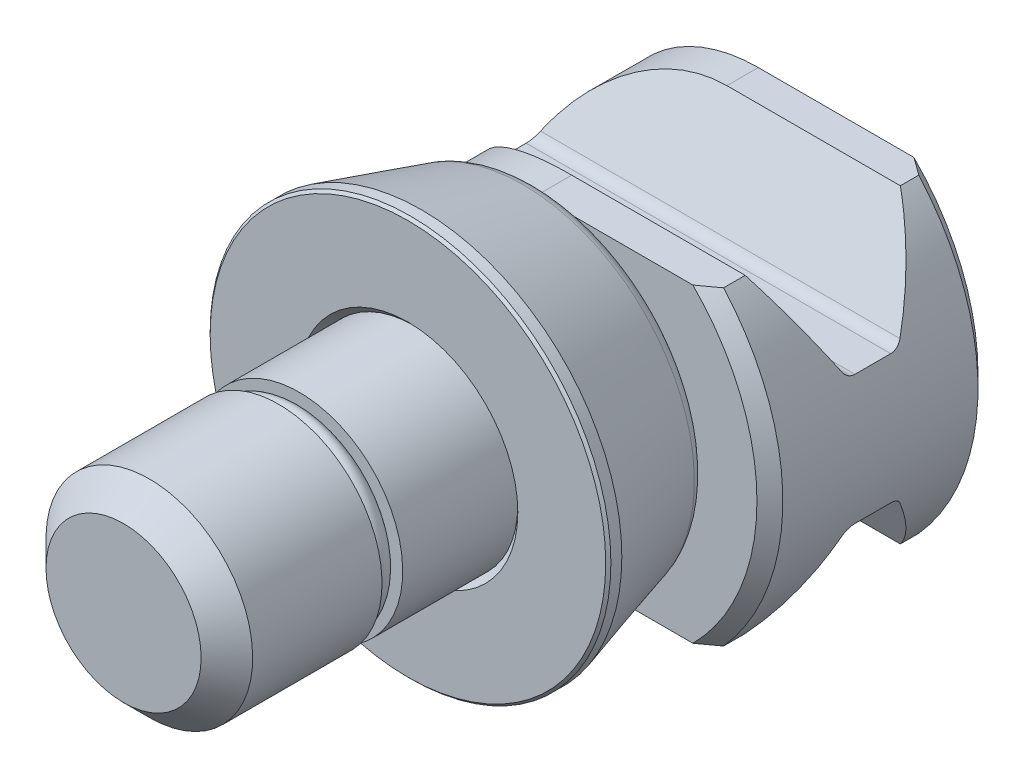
ISO-10303-21;
HEADER;
FILE_DESCRIPTION(('STEP AP214'),'2;1');
FILE_NAME('part.step','',(''),(''),'','','');
FILE_SCHEMA(('AUTOMOTIVE_DESIGN { 1 0 10303 214 1 1 1 1 }'));
ENDSEC;
DATA;
#1=APPLICATION_CONTEXT('core data for automotive mechanical design processes');
#2=APPLICATION_PROTOCOL_DEFINITION('international standard','automotive_design',2000,#1);
#3=PRODUCT_CONTEXT('',#1,'mechanical');
#4=PRODUCT('Part','Part','',(#3));
#5=PRODUCT_RELATED_PRODUCT_CATEGORY('part','',(#4));
#6=PRODUCT_DEFINITION_FORMATION('','',#4);
#7=PRODUCT_DEFINITION_CONTEXT('part definition',#1,'design');
#8=PRODUCT_DEFINITION('design','',#6,#7);
#9=PRODUCT_DEFINITION_SHAPE('','',#8);
#10=(LENGTH_UNIT() NAMED_UNIT(*) SI_UNIT(.MILLI.,.METRE.));
#11=(NAMED_UNIT(*) PLANE_ANGLE_UNIT() SI_UNIT($,.RADIAN.));
#12=(NAMED_UNIT(*) SI_UNIT($,.STERADIAN.) SOLID_ANGLE_UNIT());
#13=UNCERTAINTY_MEASURE_WITH_UNIT(LENGTH_MEASURE(1.E-05),#10,'distance_accuracy_value','');
#14=(GEOMETRIC_REPRESENTATION_CONTEXT(3) GLOBAL_UNCERTAINTY_ASSIGNED_CONTEXT((#13)) GLOBAL_UNIT_ASSIGNED_CONTEXT((#10,
#11,#12)) REPRESENTATION_CONTEXT('',''));
#15=CARTESIAN_POINT('',(0.,0.,0.));
#16=DIRECTION('',(0.,0.,1.));
#17=DIRECTION('',(1.,0.,0.));
#18=AXIS2_PLACEMENT_3D('',#15,#16,#17);
#19=CARTESIAN_POINT('',(6.7495088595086,0.0814257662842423,9.15));
#20=DIRECTION('',(0.0120630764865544,-0.999927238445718,0.));
#21=DIRECTION('',(0.,0.,1.));
#22=AXIS2_PLACEMENT_3D('',#19,#20,#21);
#23=ELLIPSE('',#22,0.75,0.75);
#24=CARTESIAN_POINT('',(0.,0.,9.15));
#25=DIRECTION('',(0.,0.,-1.));
#26=AXIS1_PLACEMENT('',#24,#25);
#27=SURFACE_OF_REVOLUTION('',#23,#26);
#28=CARTESIAN_POINT('',(0.,0.,9.4));
#29=DIRECTION('',(0.,0.,-1.));
#30=DIRECTION('',(0.,1.,0.));
#31=AXIS2_PLACEMENT_3D('',#28,#29,#30);
#32=CIRCLE('',#31,6.04289321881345);
#33=CARTESIAN_POINT('',(0.,6.04289321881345,9.4));
#34=VERTEX_POINT('',#33);
#35=EDGE_CURVE('E24',#34,#34,#32,.F.);
#36=ORIENTED_EDGE('',*,*,#35,.F.);
#37=EDGE_LOOP('',(#36));
#38=FACE_BOUND('',#37,.T.);
#39=CARTESIAN_POINT('',(0.,0.,8.4));
#40=DIRECTION('',(0.,0.,-1.));
#41=DIRECTION('',(0.,1.,0.));
#42=AXIS2_PLACEMENT_3D('',#39,#40,#41);
#43=CIRCLE('',#42,6.75);
#44=CARTESIAN_POINT('',(0.,6.75,8.4));
#45=VERTEX_POINT('',#44);
#46=EDGE_CURVE('E9',#45,#45,#43,.F.);
#47=ORIENTED_EDGE('',*,*,#46,.T.);
#48=EDGE_LOOP('',(#47));
#49=FACE_BOUND('',#48,.T.);
#50=ADVANCED_FACE('F14',(#38,#49),#27,.F.);
#51=CARTESIAN_POINT('',(0.,0.,22.));
#52=DIRECTION('',(0.,0.,1.));
#53=DIRECTION('',(0.,1.,0.));
#54=AXIS2_PLACEMENT_3D('',#51,#52,#53);
#55=PLANE('',#54);
#56=CARTESIAN_POINT('',(0.,0.,22.));
#57=DIRECTION('',(0.,0.,1.));
#58=DIRECTION('',(0.,1.,0.));
#59=AXIS2_PLACEMENT_3D('',#56,#57,#58);
#60=CIRCLE('',#59,6.);
#61=CARTESIAN_POINT('',(0.,6.,22.));
#62=VERTEX_POINT('',#61);
#63=EDGE_CURVE('E297',#62,#62,#60,.T.);
#64=ORIENTED_EDGE('',*,*,#63,.T.);
#65=EDGE_LOOP('',(#64));
#66=FACE_BOUND('',#65,.T.);
#67=ADVANCED_FACE('F411',(#66),#55,.T.);
#68=CARTESIAN_POINT('',(0.,0.,20.));
#69=DIRECTION('',(0.,0.,-1.));
#70=DIRECTION('',(0.,-1.,0.));
#71=AXIS2_PLACEMENT_3D('',#68,#69,#70);
#72=CONICAL_SURFACE('',#71,8.,0.78539816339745);
#73=CARTESIAN_POINT('',(0.,0.,20.005));
#74=DIRECTION('',(0.,0.,-1.));
#75=DIRECTION('',(0.,-1.,0.));
#76=AXIS2_PLACEMENT_3D('',#73,#74,#75);
#77=CIRCLE('',#76,7.995);
#78=CARTESIAN_POINT('',(0.,-7.995,20.005));
#79=VERTEX_POINT('',#78);
#80=EDGE_CURVE('E249',#79,#79,#77,.T.);
#81=ORIENTED_EDGE('',*,*,#80,.F.);
#82=EDGE_LOOP('',(#81));
#83=FACE_BOUND('',#82,.T.);
#84=ORIENTED_EDGE('',*,*,#63,.F.);
#85=EDGE_LOOP('',(#84));
#86=FACE_BOUND('',#85,.T.);
#87=ADVANCED_FACE('F373',(#83,#86),#72,.T.);
#88=CARTESIAN_POINT('',(0.,0.,-10.));
#89=DIRECTION('',(0.,0.,-1.));
#90=DIRECTION('',(0.,-1.,0.));
#91=AXIS2_PLACEMENT_3D('',#88,#89,#90);
#92=CYLINDRICAL_SURFACE('',#91,7.995);
#93=CARTESIAN_POINT('',(0.,0.,10.));
#94=DIRECTION('',(0.,0.,-1.));
#95=DIRECTION('',(0.,-1.,0.));
#96=AXIS2_PLACEMENT_3D('',#93,#94,#95);
#97=CIRCLE('',#96,7.995);
#98=CARTESIAN_POINT('',(0.,-7.995,10.));
#99=VERTEX_POINT('',#98);
#100=EDGE_CURVE('E243',#99,#99,#97,.T.);
#101=ORIENTED_EDGE('',*,*,#100,.F.);
#102=EDGE_LOOP('',(#101));
#103=FACE_BOUND('',#102,.T.);
#104=ORIENTED_EDGE('',*,*,#80,.T.);
#105=EDGE_LOOP('',(#104));
#106=FACE_BOUND('',#105,.T.);
#107=ADVANCED_FACE('F600',(#103,#106),#92,.T.);
#108=CARTESIAN_POINT('',(-7.995,0.,10.));
#109=DIRECTION('',(0.,0.,1.));
#110=DIRECTION('',(0.,1.,0.));
#111=AXIS2_PLACEMENT_3D('',#108,#109,#110);
#112=PLANE('',#111);
#113=CARTESIAN_POINT('',(0.,0.,10.));
#114=DIRECTION('',(0.,0.,-1.));
#115=DIRECTION('',(0.,-1.,0.));
#116=AXIS2_PLACEMENT_3D('',#113,#114,#115);
#117=CIRCLE('',#116,6.);
#118=CARTESIAN_POINT('',(0.,-6.,10.));
#119=VERTEX_POINT('',#118);
#120=EDGE_CURVE('E210',#119,#119,#117,.T.);
#121=ORIENTED_EDGE('',*,*,#120,.F.);
#122=EDGE_LOOP('',(#121));
#123=FACE_BOUND('',#122,.T.);
#124=ORIENTED_EDGE('',*,*,#100,.T.);
#125=EDGE_LOOP('',(#124));
#126=FACE_BOUND('',#125,.T.);
#127=ADVANCED_FACE('F596',(#123,#126),#112,.F.);
#128=CARTESIAN_POINT('',(0.,0.,-10.));
#129=DIRECTION('',(0.,0.,-1.));
#130=DIRECTION('',(0.,-1.,0.));
#131=AXIS2_PLACEMENT_3D('',#128,#129,#130);
#132=CYLINDRICAL_SURFACE('',#131,6.);
#133=CARTESIAN_POINT('',(0.,0.,9.4));
#134=DIRECTION('',(0.,0.,1.));
#135=DIRECTION('',(0.,1.,0.));
#136=AXIS2_PLACEMENT_3D('',#133,#134,#135);
#137=CIRCLE('',#136,6.);
#138=CARTESIAN_POINT('',(0.,6.,9.4));
#139=VERTEX_POINT('',#138);
#140=EDGE_CURVE('E19',#139,#139,#137,.T.);
#141=ORIENTED_EDGE('',*,*,#140,.T.);
#142=EDGE_LOOP('',(#141));
#143=FACE_BOUND('',#142,.T.);
#144=ORIENTED_EDGE('',*,*,#120,.T.);
#145=EDGE_LOOP('',(#144));
#146=FACE_BOUND('',#145,.T.);
#147=ADVANCED_FACE('F563',(#143,#146),#132,.T.);
#148=CARTESIAN_POINT('',(0.,0.,9.4));
#149=DIRECTION('',(0.,0.,1.));
#150=DIRECTION('',(0.,1.,0.));
#151=AXIS2_PLACEMENT_3D('',#148,#149,#150);
#152=PLANE('',#151);
#153=ORIENTED_EDGE('',*,*,#140,.F.);
#154=EDGE_LOOP('',(#153));
#155=FACE_BOUND('',#154,.T.);
#156=ORIENTED_EDGE('',*,*,#35,.T.);
#157=EDGE_LOOP('',(#156));
#158=FACE_BOUND('',#157,.T.);
#159=ADVANCED_FACE('F531',(#155,#158),#152,.T.);
#160=CARTESIAN_POINT('',(0.,0.,-0.199999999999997));
#161=DIRECTION('',(0.,0.,-1.));
#162=DIRECTION('',(0.,1.,0.));
#163=AXIS2_PLACEMENT_3D('',#160,#161,#162);
#164=CONICAL_SURFACE('',#163,15.5,0.785398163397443);
#165=CARTESIAN_POINT('',(0.,0.,0.));
#166=DIRECTION('',(0.,0.,1.));
#167=DIRECTION('',(0.,-1.,0.));
#168=AXIS2_PLACEMENT_3D('',#165,#166,#167);
#169=CIRCLE('',#168,15.3);
#170=CARTESIAN_POINT('',(0.,-15.3,0.));
#171=VERTEX_POINT('',#170);
#172=EDGE_CURVE('E515',#171,#171,#169,.T.);
#173=ORIENTED_EDGE('',*,*,#172,.F.);
#174=EDGE_LOOP('',(#173));
#175=FACE_BOUND('',#174,.T.);
#176=CARTESIAN_POINT('',(0.,0.,-0.199999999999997));
#177=DIRECTION('',(0.,0.,1.));
#178=DIRECTION('',(0.,-1.,0.));
#179=AXIS2_PLACEMENT_3D('',#176,#177,#178);
#180=CIRCLE('',#179,15.5);
#181=CARTESIAN_POINT('',(0.,-15.5,-0.199999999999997));
#182=VERTEX_POINT('',#181);
#183=EDGE_CURVE('E513',#182,#182,#180,.F.);
#184=ORIENTED_EDGE('',*,*,#183,.F.);
#185=EDGE_LOOP('',(#184));
#186=FACE_BOUND('',#185,.T.);
#187=ADVANCED_FACE('F555',(#175,#186),#164,.T.);
#188=CARTESIAN_POINT('',(0.,0.,0.));
#189=DIRECTION('',(0.,0.,1.));
#190=DIRECTION('',(0.,-1.,0.));
#191=AXIS2_PLACEMENT_3D('',#188,#189,#190);
#192=CONICAL_SURFACE('',#191,8.5,0.785398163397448);
#193=CARTESIAN_POINT('',(0.,0.,-0.5));
#194=DIRECTION('',(0.,0.,1.));
#195=DIRECTION('',(0.,-1.,0.));
#196=AXIS2_PLACEMENT_3D('',#193,#194,#195);
#197=CIRCLE('',#196,8.);
#198=CARTESIAN_POINT('',(0.,-8.,-0.5));
#199=VERTEX_POINT('',#198);
#200=EDGE_CURVE('E510',#199,#199,#197,.T.);
#201=ORIENTED_EDGE('',*,*,#200,.F.);
#202=EDGE_LOOP('',(#201));
#203=FACE_BOUND('',#202,.T.);
#204=CARTESIAN_POINT('',(0.,0.,0.));
#205=DIRECTION('',(0.,0.,1.));
#206=DIRECTION('',(0.,-1.,0.));
#207=AXIS2_PLACEMENT_3D('',#204,#205,#206);
#208=CIRCLE('',#207,8.5);
#209=CARTESIAN_POINT('',(0.,-8.5,0.));
#210=VERTEX_POINT('',#209);
#211=EDGE_CURVE('E507',#210,#210,#208,.F.);
#212=ORIENTED_EDGE('',*,*,#211,.F.);
#213=EDGE_LOOP('',(#212));
#214=FACE_BOUND('',#213,.T.);
#215=ADVANCED_FACE('F551',(#203,#214),#192,.F.);
#216=CARTESIAN_POINT('',(0.,0.,-8.5));
#217=DIRECTION('',(0.,0.,-1.));
#218=DIRECTION('',(0.,1.,0.));
#219=AXIS2_PLACEMENT_3D('',#216,#217,#218);
#220=TOROIDAL_SURFACE('',#219,11.8022150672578,1.5);
#221=CARTESIAN_POINT('',(0.,0.,-8.91345603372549));
#222=DIRECTION('',(0.,0.,-1.));
#223=DIRECTION('',(0.,1.,0.));
#224=AXIS2_PLACEMENT_3D('',#221,#222,#223);
#225=CIRCLE('',#224,13.2441076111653);
#226=CARTESIAN_POINT('',(0.,13.2441076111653,-8.91345603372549));
#227=VERTEX_POINT('',#226);
#228=EDGE_CURVE('E501',#227,#227,#225,.F.);
#229=ORIENTED_EDGE('',*,*,#228,.F.);
#230=EDGE_LOOP('',(#229));
#231=FACE_BOUND('',#230,.T.);
#232=CARTESIAN_POINT('',(0.,0.,-10.));
#233=DIRECTION('',(0.,0.,-1.));
#234=DIRECTION('',(0.,1.,0.));
#235=AXIS2_PLACEMENT_3D('',#232,#233,#234);
#236=CIRCLE('',#235,11.8022150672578);
#237=CARTESIAN_POINT('',(0.,11.8022150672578,-10.));
#238=VERTEX_POINT('',#237);
#239=EDGE_CURVE('E496',#238,#238,#236,.T.);
#240=ORIENTED_EDGE('',*,*,#239,.F.);
#241=EDGE_LOOP('',(#240));
#242=FACE_BOUND('',#241,.T.);
#243=ADVANCED_FACE('F536',(#231,#242),#220,.T.);
#244=CARTESIAN_POINT('',(8.,0.,0.));
#245=DIRECTION('',(0.,0.,1.));
#246=DIRECTION('',(0.,-1.,0.));
#247=AXIS2_PLACEMENT_3D('',#244,#245,#246);
#248=PLANE('',#247);
#249=ORIENTED_EDGE('',*,*,#172,.T.);
#250=EDGE_LOOP('',(#249));
#251=FACE_BOUND('',#250,.T.);
#252=ORIENTED_EDGE('',*,*,#211,.T.);
#253=EDGE_LOOP('',(#252));
#254=FACE_BOUND('',#253,.T.);
#255=ADVANCED_FACE('F532',(#251,#254),#248,.T.);
#256=CARTESIAN_POINT('',(0.,0.,0.));
#257=DIRECTION('',(0.,0.,-1.));
#258=DIRECTION('',(0.,1.,0.));
#259=AXIS2_PLACEMENT_3D('',#256,#257,#258);
#260=CYLINDRICAL_SURFACE('',#259,15.5);
#261=ORIENTED_EDGE('',*,*,#183,.T.);
#262=EDGE_LOOP('',(#261));
#263=FACE_BOUND('',#262,.T.);
#264=CARTESIAN_POINT('',(0.,0.,-1.04622433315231));
#265=DIRECTION('',(0.,0.,-1.));
#266=DIRECTION('',(0.,1.,0.));
#267=AXIS2_PLACEMENT_3D('',#264,#265,#266);
#268=CIRCLE('',#267,15.5);
#269=CARTESIAN_POINT('',(0.,15.5,-1.04622433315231));
#270=VERTEX_POINT('',#269);
#271=EDGE_CURVE('E492',#270,#270,#268,.T.);
#272=ORIENTED_EDGE('',*,*,#271,.F.);
#273=EDGE_LOOP('',(#272));
#274=FACE_BOUND('',#273,.T.);
#275=ADVANCED_FACE('F535',(#263,#274),#260,.T.);
#276=CARTESIAN_POINT('',(0.,0.,-10.));
#277=DIRECTION('',(0.,0.,1.));
#278=DIRECTION('',(0.,-1.,0.));
#279=AXIS2_PLACEMENT_3D('',#276,#277,#278);
#280=CONICAL_SURFACE('',#279,12.932546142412,0.279252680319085);
#281=ORIENTED_EDGE('',*,*,#228,.T.);
#282=EDGE_LOOP('',(#281));
#283=FACE_BOUND('',#282,.T.);
#284=ORIENTED_EDGE('',*,*,#271,.T.);
#285=EDGE_LOOP('',(#284));
#286=FACE_BOUND('',#285,.T.);
#287=ADVANCED_FACE('F539',(#283,#286),#280,.T.);
#288=CARTESIAN_POINT('',(0.,0.,0.));
#289=DIRECTION('',(0.,0.,-1.));
#290=DIRECTION('',(0.,1.,0.));
#291=AXIS2_PLACEMENT_3D('',#288,#289,#290);
#292=CYLINDRICAL_SURFACE('',#291,8.);
#293=ORIENTED_EDGE('',*,*,#200,.T.);
#294=EDGE_LOOP('',(#293));
#295=FACE_BOUND('',#294,.T.);
#296=CARTESIAN_POINT('',(0.,0.,-2.));
#297=DIRECTION('',(0.,0.,-1.));
#298=DIRECTION('',(0.,1.,0.));
#299=AXIS2_PLACEMENT_3D('',#296,#297,#298);
#300=CIRCLE('',#299,8.);
#301=CARTESIAN_POINT('',(0.,8.,-2.));
#302=VERTEX_POINT('',#301);
#303=EDGE_CURVE('E215',#302,#302,#300,.T.);
#304=ORIENTED_EDGE('',*,*,#303,.T.);
#305=EDGE_LOOP('',(#304));
#306=FACE_BOUND('',#305,.T.);
#307=ADVANCED_FACE('F543',(#295,#306),#292,.F.);
#308=CARTESIAN_POINT('',(-8.,0.,-2.));
#309=DIRECTION('',(0.,0.,-1.));
#310=DIRECTION('',(0.,-1.,0.));
#311=AXIS2_PLACEMENT_3D('',#308,#309,#310);
#312=PLANE('',#311);
#313=ORIENTED_EDGE('',*,*,#303,.F.);
#314=EDGE_LOOP('',(#313));
#315=FACE_BOUND('',#314,.T.);
#316=CARTESIAN_POINT('',(0.,0.,-2.));
#317=DIRECTION('',(0.,0.,-1.));
#318=DIRECTION('',(0.,-1.,0.));
#319=AXIS2_PLACEMENT_3D('',#316,#317,#318);
#320=CIRCLE('',#319,7.995);
#321=CARTESIAN_POINT('',(0.,-7.995,-2.));
#322=VERTEX_POINT('',#321);
#323=EDGE_CURVE('E246',#322,#322,#320,.T.);
#324=ORIENTED_EDGE('',*,*,#323,.T.);
#325=EDGE_LOOP('',(#324));
#326=FACE_BOUND('',#325,.T.);
#327=ADVANCED_FACE('F547',(#315,#326),#312,.F.);
#328=CARTESIAN_POINT('',(0.,0.,8.4));
#329=DIRECTION('',(0.,0.,-1.));
#330=DIRECTION('',(0.,-1.,0.));
#331=AXIS2_PLACEMENT_3D('',#328,#329,#330);
#332=CIRCLE('',#331,7.995);
#333=CARTESIAN_POINT('',(0.,-7.995,8.4));
#334=VERTEX_POINT('',#333);
#335=EDGE_CURVE('E206',#334,#334,#332,.T.);
#336=ORIENTED_EDGE('',*,*,#335,.T.);
#337=EDGE_LOOP('',(#336));
#338=FACE_BOUND('',#337,.T.);
#339=ORIENTED_EDGE('',*,*,#323,.F.);
#340=EDGE_LOOP('',(#339));
#341=FACE_BOUND('',#340,.T.);
#342=ADVANCED_FACE('F560',(#338,#341),#92,.T.);
#343=CARTESIAN_POINT('',(-7.995,0.,8.4));
#344=DIRECTION('',(0.,0.,-1.));
#345=DIRECTION('',(0.,-1.,0.));
#346=AXIS2_PLACEMENT_3D('',#343,#344,#345);
#347=PLANE('',#346);
#348=ORIENTED_EDGE('',*,*,#46,.F.);
#349=EDGE_LOOP('',(#348));
#350=FACE_BOUND('',#349,.T.);
#351=ORIENTED_EDGE('',*,*,#335,.F.);
#352=EDGE_LOOP('',(#351));
#353=FACE_BOUND('',#352,.T.);
#354=ADVANCED_FACE('F590',(#350,#353),#347,.F.);
#355=CARTESIAN_POINT('',(0.,0.,-10.));
#356=DIRECTION('',(0.,0.,1.));
#357=DIRECTION('',(0.,1.,0.));
#358=AXIS2_PLACEMENT_3D('',#355,#356,#357);
#359=PLANE('',#358);
#360=ORIENTED_EDGE('',*,*,#239,.T.);
#361=EDGE_LOOP('',(#360));
#362=FACE_BOUND('',#361,.T.);
#363=DIRECTION('',(-1.,0.,0.));
#364=VECTOR('',#363,1.);
#365=CARTESIAN_POINT('',(0.,-12.,-10.));
#366=LINE('',#365,#364);
#367=CARTESIAN_POINT('',(12.0415945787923,-12.,-10.));
#368=VERTEX_POINT('',#367);
#369=CARTESIAN_POINT('',(0.,-12.,-10.));
#370=VERTEX_POINT('',#369);
#371=EDGE_CURVE('E300',#368,#370,#366,.T.);
#372=ORIENTED_EDGE('',*,*,#371,.F.);
#373=CARTESIAN_POINT('',(0.,0.,-10.));
#374=DIRECTION('',(0.,0.,1.));
#375=DIRECTION('',(0.,1.,0.));
#376=AXIS2_PLACEMENT_3D('',#373,#374,#375);
#377=CIRCLE('',#376,17.);
#378=CARTESIAN_POINT('',(12.0415945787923,12.,-10.));
#379=VERTEX_POINT('',#378);
#380=EDGE_CURVE('E460',#368,#379,#377,.T.);
#381=ORIENTED_EDGE('',*,*,#380,.T.);
#382=DIRECTION('',(1.,0.,0.));
#383=VECTOR('',#382,1.);
#384=CARTESIAN_POINT('',(0.,12.,-10.));
#385=LINE('',#384,#383);
#386=CARTESIAN_POINT('',(0.,12.,-10.));
#387=VERTEX_POINT('',#386);
#388=EDGE_CURVE('E302',#387,#379,#385,.T.);
#389=ORIENTED_EDGE('',*,*,#388,.F.);
#390=CARTESIAN_POINT('',(0.,0.,-10.));
#391=DIRECTION('',(0.,0.,-1.));
#392=DIRECTION('',(0.,1.,0.));
#393=AXIS2_PLACEMENT_3D('',#390,#391,#392);
#394=CIRCLE('',#393,12.);
#395=EDGE_CURVE('E281',#370,#387,#394,.T.);
#396=ORIENTED_EDGE('',*,*,#395,.F.);
#397=EDGE_LOOP('',(#372,#381,#389,#396));
#398=FACE_BOUND('',#397,.T.);
#399=ADVANCED_FACE('F409',(#362,#398),#359,.T.);
#400=CARTESIAN_POINT('',(25.,-12.,-51.));
#401=DIRECTION('',(0.,1.,0.));
#402=DIRECTION('',(0.,0.,-1.));
#403=AXIS2_PLACEMENT_3D('',#400,#401,#402);
#404=PLANE('',#403);
#405=DIRECTION('',(0.,0.,-1.));
#406=VECTOR('',#405,1.);
#407=CARTESIAN_POINT('',(13.4164078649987,-12.,-10.));
#408=LINE('',#407,#406);
#409=CARTESIAN_POINT('',(13.4164078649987,-12.,-12.675426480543));
#410=VERTEX_POINT('',#409);
#411=CARTESIAN_POINT('',(13.4164078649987,-12.,-11.));
#412=VERTEX_POINT('',#411);
#413=EDGE_CURVE('E293',#410,#412,#408,.F.);
#414=ORIENTED_EDGE('',*,*,#413,.T.);
#415=CARTESIAN_POINT('',(13.4164078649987,-12.,-11.));
#416=CARTESIAN_POINT('',(13.3028148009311,-12.,-10.9153333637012));
#417=CARTESIAN_POINT('',(13.188993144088,-12.,-10.8309729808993));
#418=CARTESIAN_POINT('',(12.9608737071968,-12.,-10.6629072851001));
#419=CARTESIAN_POINT('',(12.8465759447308,-12.,-10.5792019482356));
#420=CARTESIAN_POINT('',(12.6174766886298,-12.,-10.4124824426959));
#421=CARTESIAN_POINT('',(12.5026751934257,-12.,-10.3294682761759));
#422=CARTESIAN_POINT('',(12.272539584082,-12.,-10.1641726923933));
#423=CARTESIAN_POINT('',(12.1572054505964,-12.,-10.0818913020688));
#424=CARTESIAN_POINT('',(12.0415945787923,-12.,-10.));
#425=B_SPLINE_CURVE_WITH_KNOTS('',3,(#415,#416,#417,#418,#419,#420,#421,#422,#423,#424),
.UNSPECIFIED.,.F.,.F.,(4,2,2,2,4),(0.,0.425025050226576,0.850034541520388,1.27504535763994,
1.70007173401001),.UNSPECIFIED.);
#426=EDGE_CURVE('E446',#412,#368,#425,.T.);
#427=ORIENTED_EDGE('',*,*,#426,.T.);
#428=ORIENTED_EDGE('',*,*,#371,.T.);
#429=DIRECTION('',(0.,0.,1.));
#430=VECTOR('',#429,1.);
#431=CARTESIAN_POINT('',(0.,-12.,-51.));
#432=LINE('',#431,#430);
#433=CARTESIAN_POINT('',(0.,-12.,-12.675426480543));
#434=VERTEX_POINT('',#433);
#435=EDGE_CURVE('E284',#434,#370,#432,.T.);
#436=ORIENTED_EDGE('',*,*,#435,.F.);
#437=DIRECTION('',(1.,0.,0.));
#438=VECTOR('',#437,1.);
#439=CARTESIAN_POINT('',(25.,-12.,-12.675426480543));
#440=LINE('',#439,#438);
#441=EDGE_CURVE('E310',#434,#410,#440,.T.);
#442=ORIENTED_EDGE('',*,*,#441,.T.);
#443=EDGE_LOOP('',(#414,#427,#428,#436,#442));
#444=FACE_BOUND('',#443,.T.);
#445=ADVANCED_FACE('F408',(#444),#404,.F.);
#446=CARTESIAN_POINT('',(0.,0.,-11.));
#447=DIRECTION('',(0.,0.,-1.));
#448=DIRECTION('',(0.,-1.,0.));
#449=AXIS2_PLACEMENT_3D('',#446,#447,#448);
#450=CONICAL_SURFACE('',#449,18.,0.785398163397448);
#451=CARTESIAN_POINT('',(12.0415945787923,12.,-10.));
#452=CARTESIAN_POINT('',(12.1572054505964,12.,-10.0818913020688));
#453=CARTESIAN_POINT('',(12.272539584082,12.,-10.1641726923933));
#454=CARTESIAN_POINT('',(12.5026751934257,12.,-10.3294682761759));
#455=CARTESIAN_POINT('',(12.6174766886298,12.,-10.4124824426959));
#456=CARTESIAN_POINT('',(12.8465759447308,12.,-10.5792019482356));
#457=CARTESIAN_POINT('',(12.9608737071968,12.,-10.6629072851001));
#458=CARTESIAN_POINT('',(13.188993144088,12.,-10.8309729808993));
#459=CARTESIAN_POINT('',(13.3028148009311,12.,-10.9153333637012));
#460=CARTESIAN_POINT('',(13.4164078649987,12.,-11.));
#461=B_SPLINE_CURVE_WITH_KNOTS('',3,(#451,#452,#453,#454,#455,#456,#457,#458,#459,#460),
.UNSPECIFIED.,.F.,.F.,(4,2,2,2,4),(0.,0.425026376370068,0.85003719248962,1.27504668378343,
1.70007173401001),.UNSPECIFIED.);
#462=CARTESIAN_POINT('',(13.4164078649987,12.,-11.));
#463=VERTEX_POINT('',#462);
#464=EDGE_CURVE('E453',#379,#463,#461,.T.);
#465=ORIENTED_EDGE('',*,*,#464,.F.);
#466=ORIENTED_EDGE('',*,*,#380,.F.);
#467=ORIENTED_EDGE('',*,*,#426,.F.);
#468=CARTESIAN_POINT('',(0.,0.,-11.));
#469=DIRECTION('',(0.,0.,1.));
#470=DIRECTION('',(0.,1.,0.));
#471=AXIS2_PLACEMENT_3D('',#468,#469,#470);
#472=CIRCLE('',#471,18.);
#473=EDGE_CURVE('E906',#463,#412,#472,.F.);
#474=ORIENTED_EDGE('',*,*,#473,.F.);
#475=EDGE_LOOP('',(#465,#466,#467,#474));
#476=FACE_BOUND('',#475,.T.);
#477=ADVANCED_FACE('F439',(#476),#450,.T.);
#478=CARTESIAN_POINT('',(25.,12.,-51.));
#479=DIRECTION('',(0.,-1.,0.));
#480=DIRECTION('',(0.,0.,1.));
#481=AXIS2_PLACEMENT_3D('',#478,#479,#480);
#482=PLANE('',#481);
#483=ORIENTED_EDGE('',*,*,#388,.T.);
#484=ORIENTED_EDGE('',*,*,#464,.T.);
#485=DIRECTION('',(0.,0.,-1.));
#486=VECTOR('',#485,1.);
#487=CARTESIAN_POINT('',(13.4164078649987,12.,-10.));
#488=LINE('',#487,#486);
#489=CARTESIAN_POINT('',(13.4164078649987,12.,-12.6754264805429));
#490=VERTEX_POINT('',#489);
#491=EDGE_CURVE('E291',#463,#490,#488,.T.);
#492=ORIENTED_EDGE('',*,*,#491,.T.);
#493=DIRECTION('',(-1.,0.,0.));
#494=VECTOR('',#493,1.);
#495=CARTESIAN_POINT('',(25.,12.,-12.675426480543));
#496=LINE('',#495,#494);
#497=CARTESIAN_POINT('',(0.,12.,-12.675426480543));
#498=VERTEX_POINT('',#497);
#499=EDGE_CURVE('E255',#490,#498,#496,.T.);
#500=ORIENTED_EDGE('',*,*,#499,.T.);
#501=DIRECTION('',(0.,0.,1.));
#502=VECTOR('',#501,1.);
#503=CARTESIAN_POINT('',(0.,12.,-51.));
#504=LINE('',#503,#502);
#505=EDGE_CURVE('E285',#498,#387,#504,.T.);
#506=ORIENTED_EDGE('',*,*,#505,.T.);
#507=EDGE_LOOP('',(#483,#484,#492,#500,#506));
#508=FACE_BOUND('',#507,.T.);
#509=ADVANCED_FACE('F407',(#508),#482,.F.);
#510=CARTESIAN_POINT('',(0.,0.,-51.));
#511=DIRECTION('',(0.,0.,1.));
#512=DIRECTION('',(0.,1.,0.));
#513=AXIS2_PLACEMENT_3D('',#510,#511,#512);
#514=CYLINDRICAL_SURFACE('',#513,12.);
#515=CARTESIAN_POINT('',(0.,0.,-17.7472232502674));
#516=DIRECTION('',(0.,0.5,0.866025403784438));
#517=DIRECTION('',(0.,-0.866025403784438,0.5));
#518=AXIS2_PLACEMENT_3D('',#515,#516,#517);
#519=ELLIPSE('',#518,13.856406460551,12.);
#520=CARTESIAN_POINT('',(0.,12.,-24.6754264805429));
#521=VERTEX_POINT('',#520);
#522=CARTESIAN_POINT('',(-10.6653645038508,5.5,-20.9226497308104));
#523=VERTEX_POINT('',#522);
#524=EDGE_CURVE('E262',#521,#523,#519,.T.);
#525=ORIENTED_EDGE('',*,*,#524,.F.);
#526=CARTESIAN_POINT('',(0.,12.,-27.1));
#527=VERTEX_POINT('',#526);
#528=EDGE_CURVE('E287',#527,#521,#504,.T.);
#529=ORIENTED_EDGE('',*,*,#528,.F.);
#530=CARTESIAN_POINT('',(0.,0.,-27.1));
#531=DIRECTION('',(0.,0.,1.));
#532=DIRECTION('',(0.,1.,0.));
#533=AXIS2_PLACEMENT_3D('',#530,#531,#532);
#534=CIRCLE('',#533,12.);
#535=CARTESIAN_POINT('',(0.,-12.,-27.1));
#536=VERTEX_POINT('',#535);
#537=EDGE_CURVE('E305',#527,#536,#534,.T.);
#538=ORIENTED_EDGE('',*,*,#537,.T.);
#539=CARTESIAN_POINT('',(0.,-12.,-24.6754264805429));
#540=VERTEX_POINT('',#539);
#541=EDGE_CURVE('E288',#536,#540,#432,.T.);
#542=ORIENTED_EDGE('',*,*,#541,.T.);
#543=CARTESIAN_POINT('',(0.,0.,-17.7472232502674));
#544=DIRECTION('',(0.,0.5,-0.866025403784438));
#545=DIRECTION('',(0.,0.866025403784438,0.5));
#546=AXIS2_PLACEMENT_3D('',#543,#544,#545);
#547=ELLIPSE('',#546,13.856406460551,12.);
#548=CARTESIAN_POINT('',(-10.6653645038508,-5.5,-20.9226497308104));
#549=VERTEX_POINT('',#548);
#550=EDGE_CURVE('E271',#540,#549,#547,.T.);
#551=ORIENTED_EDGE('',*,*,#550,.T.);
#552=CARTESIAN_POINT('',(-10.6653645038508,-5.5,-20.9226497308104));
#553=CARTESIAN_POINT('',(-10.6774347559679,-5.47659477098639,-20.9091356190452));
#554=CARTESIAN_POINT('',(-10.6891836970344,-5.45362151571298,-20.8946068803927));
#555=CARTESIAN_POINT('',(-10.7119857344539,-5.40869623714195,-20.8635366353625));
#556=CARTESIAN_POINT('',(-10.7230384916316,-5.38674471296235,-20.8469941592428));
#557=CARTESIAN_POINT('',(-10.7550987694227,-5.3226057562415,-20.794320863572));
#558=CARTESIAN_POINT('',(-10.7749588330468,-5.28223029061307,-20.7551991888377));
#559=CARTESIAN_POINT('',(-10.8110922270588,-5.20787932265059,-20.6696252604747));
#560=CARTESIAN_POINT('',(-10.8273544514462,-5.17392368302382,-20.6231510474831));
#561=CARTESIAN_POINT('',(-10.8557255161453,-5.11412973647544,-20.5241377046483));
#562=CARTESIAN_POINT('',(-10.8678390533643,-5.08828225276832,-20.4716055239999));
#563=CARTESIAN_POINT('',(-10.8868237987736,-5.04752786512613,-20.3660831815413));
#564=CARTESIAN_POINT('',(-10.8940116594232,-5.03196310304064,-20.3134029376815));
#565=CARTESIAN_POINT('',(-10.9042731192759,-5.00968918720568,-20.2058928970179));
#566=CARTESIAN_POINT('',(-10.9073566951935,-5.00295855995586,-20.1510686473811));
#567=CARTESIAN_POINT('',(-10.9085935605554,-5.00025823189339,-20.0829516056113));
#568=CARTESIAN_POINT('',(-10.9087129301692,-4.99999754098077,-20.0697849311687));
#569=CARTESIAN_POINT('',(-10.9087121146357,-5.,-20.056624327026));
#570=B_SPLINE_CURVE_WITH_KNOTS('',3,(#552,#553,#554,#555,#556,#557,#558,#559,#560,#561,#562,
#563,#564,#565,#566,#567,#568,#569),.UNSPECIFIED.,.F.,.F.,(4,2,2,2,2,2,2,2,4),(0.,
0.0887543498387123,0.177551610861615,0.355506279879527,0.534002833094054,0.712296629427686,
0.87765105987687,1.04260280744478,1.08209840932),.UNSPECIFIED.);
#571=CARTESIAN_POINT('',(-10.9087121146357,-5.,-20.056624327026));
#572=VERTEX_POINT('',#571);
#573=EDGE_CURVE('E422',#549,#572,#570,.T.);
#574=ORIENTED_EDGE('',*,*,#573,.T.);
#575=DIRECTION('',(0.,0.,1.));
#576=VECTOR('',#575,1.);
#577=CARTESIAN_POINT('',(-10.9087121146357,-5.,-51.));
#578=LINE('',#577,#576);
#579=CARTESIAN_POINT('',(-10.9087121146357,-5.,-17.2942286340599));
#580=VERTEX_POINT('',#579);
#581=EDGE_CURVE('E278',#572,#580,#578,.T.);
#582=ORIENTED_EDGE('',*,*,#581,.T.);
#583=CARTESIAN_POINT('',(-10.9087121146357,-5.,-17.2942286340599));
#584=CARTESIAN_POINT('',(-10.9087119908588,-4.99999901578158,-17.2680479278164));
#585=CARTESIAN_POINT('',(-10.9082405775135,-5.00102890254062,-17.2418803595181));
#586=CARTESIAN_POINT('',(-10.9063598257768,-5.00512966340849,-17.1897447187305));
#587=CARTESIAN_POINT('',(-10.9049506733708,-5.0082001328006,-17.1637766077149));
#588=CARTESIAN_POINT('',(-10.8993375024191,-5.02041102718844,-17.0866107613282));
#589=CARTESIAN_POINT('',(-10.8937476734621,-5.03255129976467,-17.0359508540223));
#590=CARTESIAN_POINT('',(-10.8790192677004,-5.06431057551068,-16.9376362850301));
#591=CARTESIAN_POINT('',(-10.8698816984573,-5.08392745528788,-16.8899807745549));
#592=CARTESIAN_POINT('',(-10.848284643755,-5.12985004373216,-16.7988047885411));
#593=CARTESIAN_POINT('',(-10.8358234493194,-5.15615919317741,-16.7552864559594));
#594=CARTESIAN_POINT('',(-10.8074414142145,-5.21539261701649,-16.6720682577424));
#595=CARTESIAN_POINT('',(-10.791423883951,-5.24849930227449,-16.6325320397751));
#596=CARTESIAN_POINT('',(-10.7565491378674,-5.31960642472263,-16.5596162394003));
#597=CARTESIAN_POINT('',(-10.7376929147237,-5.35760515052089,-16.5262345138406));
#598=CARTESIAN_POINT('',(-10.7093127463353,-5.41396025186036,-16.4836805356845));
#599=CARTESIAN_POINT('',(-10.700780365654,-5.43080742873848,-16.471767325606));
#600=CARTESIAN_POINT('',(-10.6833469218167,-5.46502205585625,-16.4491146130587));
#601=CARTESIAN_POINT('',(-10.6744467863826,-5.48238816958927,-16.4383723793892));
#602=CARTESIAN_POINT('',(-10.6653645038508,-5.5,-16.4282032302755));
#603=B_SPLINE_CURVE_WITH_KNOTS('',3,(#583,#584,#585,#586,#587,#588,#589,#590,#591,#592,#593,
#594,#595,#596,#597,#598,#599,#600,#601,#602),.UNSPECIFIED.,.F.,.F.,(4,2,2,2,2,2,2,2,2,4),(0.,
0.0784918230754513,0.156968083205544,0.313326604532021,0.469640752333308,0.626035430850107,
0.787360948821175,0.948630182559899,1.01558382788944,1.08237780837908),.UNSPECIFIED.);
#604=CARTESIAN_POINT('',(-10.6653645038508,-5.5,-16.4282032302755));
#605=VERTEX_POINT('',#604);
#606=EDGE_CURVE('E396',#580,#605,#603,.T.);
#607=ORIENTED_EDGE('',*,*,#606,.T.);
#608=CARTESIAN_POINT('',(0.,0.,-19.6036297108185));
#609=DIRECTION('',(0.,0.5,0.866025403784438));
#610=DIRECTION('',(0.,-0.866025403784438,0.5));
#611=AXIS2_PLACEMENT_3D('',#608,#609,#610);
#612=ELLIPSE('',#611,13.856406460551,12.);
#613=EDGE_CURVE('E276',#605,#434,#612,.T.);
#614=ORIENTED_EDGE('',*,*,#613,.T.);
#615=ORIENTED_EDGE('',*,*,#435,.T.);
#616=ORIENTED_EDGE('',*,*,#395,.T.);
#617=ORIENTED_EDGE('',*,*,#505,.F.);
#618=CARTESIAN_POINT('',(0.,0.,-19.6036297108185));
#619=DIRECTION('',(0.,0.5,-0.866025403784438));
#620=DIRECTION('',(0.,0.866025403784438,0.5));
#621=AXIS2_PLACEMENT_3D('',#618,#619,#620);
#622=ELLIPSE('',#621,13.856406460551,12.);
#623=CARTESIAN_POINT('',(-10.6653645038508,5.5,-16.4282032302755));
#624=VERTEX_POINT('',#623);
#625=EDGE_CURVE('E258',#624,#498,#622,.T.);
#626=ORIENTED_EDGE('',*,*,#625,.F.);
#627=CARTESIAN_POINT('',(-10.6653645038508,5.5,-16.4282032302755));
#628=CARTESIAN_POINT('',(-10.6774347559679,5.47659477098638,-16.4417173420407));
#629=CARTESIAN_POINT('',(-10.6891836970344,5.45362151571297,-16.4562460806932));
#630=CARTESIAN_POINT('',(-10.7119857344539,5.40869623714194,-16.4873163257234));
#631=CARTESIAN_POINT('',(-10.7230384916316,5.38674471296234,-16.5038588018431));
#632=CARTESIAN_POINT('',(-10.7550987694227,5.32260575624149,-16.5565320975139));
#633=CARTESIAN_POINT('',(-10.7749588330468,5.28223029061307,-16.5956537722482));
#634=CARTESIAN_POINT('',(-10.8110922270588,5.20787932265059,-16.6812277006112));
#635=CARTESIAN_POINT('',(-10.8273544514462,5.17392368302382,-16.7277019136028));
#636=CARTESIAN_POINT('',(-10.8557255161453,5.11412973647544,-16.8267152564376));
#637=CARTESIAN_POINT('',(-10.8678390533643,5.08828225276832,-16.879247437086));
#638=CARTESIAN_POINT('',(-10.8868237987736,5.04752786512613,-16.9847697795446));
#639=CARTESIAN_POINT('',(-10.8940116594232,5.03196310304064,-17.0374500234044));
#640=CARTESIAN_POINT('',(-10.9042731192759,5.00968918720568,-17.144960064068));
#641=CARTESIAN_POINT('',(-10.9073566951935,5.00295855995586,-17.1997843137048));
#642=CARTESIAN_POINT('',(-10.9085935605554,5.00025823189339,-17.2679013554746));
#643=CARTESIAN_POINT('',(-10.9087129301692,4.99999754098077,-17.2810680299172));
#644=CARTESIAN_POINT('',(-10.9087121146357,5.,-17.2942286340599));
#645=B_SPLINE_CURVE_WITH_KNOTS('',3,(#627,#628,#629,#630,#631,#632,#633,#634,#635,#636,#637,
#638,#639,#640,#641,#642,#643,#644),.UNSPECIFIED.,.F.,.F.,(4,2,2,2,2,2,2,2,4),(0.,
0.0887543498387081,0.177551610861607,0.355506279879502,0.534002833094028,0.712296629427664,
0.877651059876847,1.04260280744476,1.08209840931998),.UNSPECIFIED.);
#646=CARTESIAN_POINT('',(-10.9087121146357,5.,-17.2942286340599));
#647=VERTEX_POINT('',#646);
#648=EDGE_CURVE('E384',#624,#647,#645,.T.);
#649=ORIENTED_EDGE('',*,*,#648,.T.);
#650=DIRECTION('',(0.,0.,1.));
#651=VECTOR('',#650,1.);
#652=CARTESIAN_POINT('',(-10.9087121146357,5.,-51.));
#653=LINE('',#652,#651);
#654=CARTESIAN_POINT('',(-10.9087121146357,5.,-20.056624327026));
#655=VERTEX_POINT('',#654);
#656=EDGE_CURVE('E265',#655,#647,#653,.T.);
#657=ORIENTED_EDGE('',*,*,#656,.F.);
#658=CARTESIAN_POINT('',(-10.9087121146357,5.,-20.056624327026));
#659=CARTESIAN_POINT('',(-10.9087119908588,4.99999901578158,-20.0828050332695));
#660=CARTESIAN_POINT('',(-10.9082405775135,5.00102890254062,-20.1089726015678));
#661=CARTESIAN_POINT('',(-10.9063598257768,5.00512966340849,-20.1611082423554));
#662=CARTESIAN_POINT('',(-10.9049506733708,5.0082001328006,-20.187076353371));
#663=CARTESIAN_POINT('',(-10.8993375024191,5.02041102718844,-20.2642421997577));
#664=CARTESIAN_POINT('',(-10.8937476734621,5.03255129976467,-20.3149021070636));
#665=CARTESIAN_POINT('',(-10.8790192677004,5.06431057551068,-20.4132166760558));
#666=CARTESIAN_POINT('',(-10.8698816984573,5.08392745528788,-20.460872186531));
#667=CARTESIAN_POINT('',(-10.848284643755,5.12985004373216,-20.5520481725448));
#668=CARTESIAN_POINT('',(-10.8358234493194,5.1561591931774,-20.5955665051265));
#669=CARTESIAN_POINT('',(-10.8074414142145,5.21539261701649,-20.6787847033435));
#670=CARTESIAN_POINT('',(-10.791423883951,5.2484993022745,-20.7183209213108));
#671=CARTESIAN_POINT('',(-10.7565491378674,5.31960642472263,-20.7912367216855));
#672=CARTESIAN_POINT('',(-10.7376929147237,5.35760515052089,-20.8246184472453));
#673=CARTESIAN_POINT('',(-10.7093127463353,5.41396025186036,-20.8671724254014));
#674=CARTESIAN_POINT('',(-10.700780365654,5.43080742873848,-20.8790856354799));
#675=CARTESIAN_POINT('',(-10.6833469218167,5.46502205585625,-20.9017383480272));
#676=CARTESIAN_POINT('',(-10.6744467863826,5.48238816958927,-20.9124805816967));
#677=CARTESIAN_POINT('',(-10.6653645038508,5.5,-20.9226497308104));
#678=B_SPLINE_CURVE_WITH_KNOTS('',3,(#658,#659,#660,#661,#662,#663,#664,#665,#666,#667,#668,
#669,#670,#671,#672,#673,#674,#675,#676,#677),.UNSPECIFIED.,.F.,.F.,(4,2,2,2,2,2,2,2,2,4),(0.,
0.0784918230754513,0.156968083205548,0.313326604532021,0.469640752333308,0.62603543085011,
0.787360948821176,0.948630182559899,1.01558382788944,1.08237780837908),.UNSPECIFIED.);
#679=EDGE_CURVE('E345',#655,#523,#678,.T.);
#680=ORIENTED_EDGE('',*,*,#679,.T.);
#681=EDGE_LOOP('',(#525,#529,#538,#542,#551,#574,#582,#607,#614,#615,#616,#617,#626,#649,#657,#680));
#682=FACE_BOUND('',#681,.T.);
#683=ADVANCED_FACE('F360',(#682),#514,.T.);
#684=CARTESIAN_POINT('',(0.,0.,-10.));
#685=DIRECTION('',(0.,0.,-1.));
#686=DIRECTION('',(0.,-1.,0.));
#687=AXIS2_PLACEMENT_3D('',#684,#685,#686);
#688=CYLINDRICAL_SURFACE('',#687,18.);
#689=CARTESIAN_POINT('',(13.4164078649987,-12.,-26.1));
#690=VERTEX_POINT('',#689);
#691=CARTESIAN_POINT('',(13.4164078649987,-12.,-24.6754264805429));
#692=VERTEX_POINT('',#691);
#693=EDGE_CURVE('E295',#690,#692,#408,.F.);
#694=ORIENTED_EDGE('',*,*,#693,.F.);
#695=CARTESIAN_POINT('',(0.,0.,-26.1));
#696=DIRECTION('',(0.,0.,1.));
#697=DIRECTION('',(0.,1.,0.));
#698=AXIS2_PLACEMENT_3D('',#695,#696,#697);
#699=CIRCLE('',#698,18.);
#700=CARTESIAN_POINT('',(13.4164078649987,12.,-26.1));
#701=VERTEX_POINT('',#700);
#702=EDGE_CURVE('E40',#690,#701,#699,.T.);
#703=ORIENTED_EDGE('',*,*,#702,.T.);
#704=CARTESIAN_POINT('',(13.4164078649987,12.,-24.6754264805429));
#705=VERTEX_POINT('',#704);
#706=EDGE_CURVE('E294',#705,#701,#488,.T.);
#707=ORIENTED_EDGE('',*,*,#706,.F.);
#708=CARTESIAN_POINT('',(0.,0.,-17.7472232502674));
#709=DIRECTION('',(0.,0.5,0.866025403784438));
#710=DIRECTION('',(0.,0.866025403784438,-0.5));
#711=AXIS2_PLACEMENT_3D('',#708,#709,#710);
#712=ELLIPSE('',#711,20.7846096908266,18.);
#713=CARTESIAN_POINT('',(17.1391365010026,5.5,-20.9226497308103));
#714=VERTEX_POINT('',#713);
#715=EDGE_CURVE('E322',#705,#714,#712,.F.);
#716=ORIENTED_EDGE('',*,*,#715,.T.);
#717=CARTESIAN_POINT('',(17.1391365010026,5.5,-20.9226497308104));
#718=CARTESIAN_POINT('',(17.1468134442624,5.47607777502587,-20.9088379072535));
#719=CARTESIAN_POINT('',(17.1542650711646,5.45268396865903,-20.8940092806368));
#720=CARTESIAN_POINT('',(17.1686862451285,5.40710483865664,-20.8623822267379));
#721=CARTESIAN_POINT('',(17.1756557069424,5.38491972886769,-20.8455834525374));
#722=CARTESIAN_POINT('',(17.1957772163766,5.32045742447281,-20.7923685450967));
#723=CARTESIAN_POINT('',(17.2081567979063,5.28022815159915,-20.7531078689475));
#724=CARTESIAN_POINT('',(17.2305783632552,5.2065978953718,-20.6679269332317));
#725=CARTESIAN_POINT('',(17.2406155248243,5.17321101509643,-20.6219932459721));
#726=CARTESIAN_POINT('',(17.2581078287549,5.11455292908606,-20.5248160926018));
#727=CARTESIAN_POINT('',(17.2655651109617,5.08927499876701,-20.4735770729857));
#728=CARTESIAN_POINT('',(17.27824135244,5.04608091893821,-20.3629431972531));
#729=CARTESIAN_POINT('',(17.2832337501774,5.02891472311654,-20.3032238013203));
#730=CARTESIAN_POINT('',(17.2882514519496,5.01162584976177,-20.2118374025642));
#731=CARTESIAN_POINT('',(17.2895122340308,5.00727274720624,-20.1809773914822));
#732=CARTESIAN_POINT('',(17.2911945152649,5.00145947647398,-20.1189598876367));
#733=CARTESIAN_POINT('',(17.2916159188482,4.99999963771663,-20.0878023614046));
#734=CARTESIAN_POINT('',(17.2916164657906,5.,-20.056624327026));
#735=B_SPLINE_CURVE_WITH_KNOTS('',3,(#717,#718,#719,#720,#721,#722,#723,#724,#725,#726,#727,
#728,#729,#730,#731,#732,#733,#734),.UNSPECIFIED.,.F.,.F.,(4,2,2,2,2,2,2,2,4),(0.,
0.0859625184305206,0.171940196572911,0.343735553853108,0.51588151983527,0.687884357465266,
0.873635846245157,0.967081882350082,1.06053855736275),.UNSPECIFIED.);
#736=CARTESIAN_POINT('',(17.2916164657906,5.,-20.056624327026));
#737=VERTEX_POINT('',#736);
#738=EDGE_CURVE('E353',#714,#737,#735,.T.);
#739=ORIENTED_EDGE('',*,*,#738,.T.);
#740=DIRECTION('',(0.,0.,-1.));
#741=VECTOR('',#740,1.);
#742=CARTESIAN_POINT('',(17.2916164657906,5.,-10.));
#743=LINE('',#742,#741);
#744=CARTESIAN_POINT('',(17.2916164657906,5.,-17.2942286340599));
#745=VERTEX_POINT('',#744);
#746=EDGE_CURVE('E319',#737,#745,#743,.F.);
#747=ORIENTED_EDGE('',*,*,#746,.T.);
#748=CARTESIAN_POINT('',(17.2916164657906,5.,-17.2942286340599));
#749=CARTESIAN_POINT('',(17.291616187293,4.99999964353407,-17.2669410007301));
#750=CARTESIAN_POINT('',(17.2912933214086,5.00111767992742,-17.2396666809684));
#751=CARTESIAN_POINT('',(17.2900038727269,5.00557429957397,-17.1853184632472));
#752=CARTESIAN_POINT('',(17.2890373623,5.00891263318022,-17.1582445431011));
#753=CARTESIAN_POINT('',(17.2851817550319,5.02220888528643,-17.0777275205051));
#754=CARTESIAN_POINT('',(17.2813365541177,5.03544827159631,-17.0248322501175));
#755=CARTESIAN_POINT('',(17.2711655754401,5.07022323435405,-16.9221271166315));
#756=CARTESIAN_POINT('',(17.2648395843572,5.09175952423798,-16.8723175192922));
#757=CARTESIAN_POINT('',(17.2498202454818,5.14241151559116,-16.7770720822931));
#758=CARTESIAN_POINT('',(17.2411257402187,5.17153092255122,-16.731638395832));
#759=CARTESIAN_POINT('',(17.2213892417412,5.23688208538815,-16.6456823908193));
#760=CARTESIAN_POINT('',(17.2103137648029,5.2732146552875,-16.6052446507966));
#761=CARTESIAN_POINT('',(17.1861248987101,5.35152097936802,-16.5310941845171));
#762=CARTESIAN_POINT('',(17.1730143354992,5.39348690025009,-16.4973722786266));
#763=CARTESIAN_POINT('',(17.1525775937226,5.45798018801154,-16.4534992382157));
#764=CARTESIAN_POINT('',(17.1459432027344,5.47879086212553,-16.4404414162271));
#765=CARTESIAN_POINT('',(17.1391365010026,5.5,-16.4282032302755));
#766=B_SPLINE_CURVE_WITH_KNOTS('',3,(#748,#749,#750,#751,#752,#753,#754,#755,#756,#757,#758,
#759,#760,#761,#762,#763,#764,#765),.UNSPECIFIED.,.F.,.F.,(4,2,2,2,2,2,2,2,4),(0.,
0.0818117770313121,0.163614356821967,0.326754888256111,0.48990945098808,0.653143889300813,
0.818844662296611,0.98431736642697,1.06058686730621),.UNSPECIFIED.);
#767=CARTESIAN_POINT('',(17.1391365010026,5.5,-16.4282032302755));
#768=VERTEX_POINT('',#767);
#769=EDGE_CURVE('E390',#745,#768,#766,.T.);
#770=ORIENTED_EDGE('',*,*,#769,.T.);
#771=CARTESIAN_POINT('',(0.,0.,-19.6036297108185));
#772=DIRECTION('',(0.,0.5,-0.866025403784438));
#773=DIRECTION('',(0.,-0.866025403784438,-0.5));
#774=AXIS2_PLACEMENT_3D('',#771,#772,#773);
#775=ELLIPSE('',#774,20.7846096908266,18.);
#776=EDGE_CURVE('E316',#768,#490,#775,.F.);
#777=ORIENTED_EDGE('',*,*,#776,.T.);
#778=ORIENTED_EDGE('',*,*,#491,.F.);
#779=ORIENTED_EDGE('',*,*,#473,.T.);
#780=ORIENTED_EDGE('',*,*,#413,.F.);
#781=CARTESIAN_POINT('',(0.,0.,-19.6036297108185));
#782=DIRECTION('',(0.,0.5,0.866025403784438));
#783=DIRECTION('',(0.,0.866025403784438,-0.5));
#784=AXIS2_PLACEMENT_3D('',#781,#782,#783);
#785=ELLIPSE('',#784,20.7846096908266,18.);
#786=CARTESIAN_POINT('',(17.1391365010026,-5.5,-16.4282032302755));
#787=VERTEX_POINT('',#786);
#788=EDGE_CURVE('E274',#787,#410,#785,.F.);
#789=ORIENTED_EDGE('',*,*,#788,.F.);
#790=CARTESIAN_POINT('',(17.1391365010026,-5.5,-16.4282032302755));
#791=CARTESIAN_POINT('',(17.1468134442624,-5.47607777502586,-16.4420150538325));
#792=CARTESIAN_POINT('',(17.1542650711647,-5.45268396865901,-16.4568436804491));
#793=CARTESIAN_POINT('',(17.1686862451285,-5.40710483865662,-16.488470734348));
#794=CARTESIAN_POINT('',(17.1756557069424,-5.38491972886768,-16.5052695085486));
#795=CARTESIAN_POINT('',(17.1957772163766,-5.3204574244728,-16.5584844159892));
#796=CARTESIAN_POINT('',(17.2081567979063,-5.28022815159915,-16.5977450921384));
#797=CARTESIAN_POINT('',(17.2305783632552,-5.2065978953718,-16.6829260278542));
#798=CARTESIAN_POINT('',(17.2406155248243,-5.17321101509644,-16.7288597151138));
#799=CARTESIAN_POINT('',(17.2581078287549,-5.11455292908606,-16.8260368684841));
#800=CARTESIAN_POINT('',(17.2655651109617,-5.08927499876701,-16.8772758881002));
#801=CARTESIAN_POINT('',(17.27824135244,-5.04608091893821,-16.9879097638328));
#802=CARTESIAN_POINT('',(17.2832337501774,-5.02891472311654,-17.0476291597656));
#803=CARTESIAN_POINT('',(17.2882514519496,-5.01162584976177,-17.1390155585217));
#804=CARTESIAN_POINT('',(17.2895122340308,-5.00727274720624,-17.1698755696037));
#805=CARTESIAN_POINT('',(17.2911945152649,-5.00145947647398,-17.2318930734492));
#806=CARTESIAN_POINT('',(17.2916159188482,-4.99999963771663,-17.2630505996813));
#807=CARTESIAN_POINT('',(17.2916164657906,-5.,-17.2942286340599));
#808=B_SPLINE_CURVE_WITH_KNOTS('',3,(#790,#791,#792,#793,#794,#795,#796,#797,#798,#799,#800,
#801,#802,#803,#804,#805,#806,#807),.UNSPECIFIED.,.F.,.F.,(4,2,2,2,2,2,2,2,4),(0.,
0.0859625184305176,0.1719401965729,0.343735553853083,0.515881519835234,0.687884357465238,
0.873635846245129,0.967081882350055,1.06053855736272),.UNSPECIFIED.);
#809=CARTESIAN_POINT('',(17.2916164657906,-5.,-17.2942286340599));
#810=VERTEX_POINT('',#809);
#811=EDGE_CURVE('E416',#787,#810,#808,.T.);
#812=ORIENTED_EDGE('',*,*,#811,.T.);
#813=DIRECTION('',(0.,0.,-1.));
#814=VECTOR('',#813,1.);
#815=CARTESIAN_POINT('',(17.2916164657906,-5.,-10.));
#816=LINE('',#815,#814);
#817=CARTESIAN_POINT('',(17.2916164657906,-5.,-20.056624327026));
#818=VERTEX_POINT('',#817);
#819=EDGE_CURVE('E313',#818,#810,#816,.F.);
#820=ORIENTED_EDGE('',*,*,#819,.F.);
#821=CARTESIAN_POINT('',(17.2916164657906,-5.,-20.056624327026));
#822=CARTESIAN_POINT('',(17.291616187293,-4.99999964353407,-20.0839119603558));
#823=CARTESIAN_POINT('',(17.2912933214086,-5.00111767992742,-20.1111862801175));
#824=CARTESIAN_POINT('',(17.2900038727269,-5.00557429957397,-20.1655344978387));
#825=CARTESIAN_POINT('',(17.2890373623,-5.00891263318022,-20.1926084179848));
#826=CARTESIAN_POINT('',(17.2851817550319,-5.02220888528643,-20.2731254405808));
#827=CARTESIAN_POINT('',(17.2813365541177,-5.03544827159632,-20.3260207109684));
#828=CARTESIAN_POINT('',(17.2711655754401,-5.07022323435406,-20.4287258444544));
#829=CARTESIAN_POINT('',(17.2648395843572,-5.09175952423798,-20.4785354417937));
#830=CARTESIAN_POINT('',(17.2498202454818,-5.14241151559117,-20.5737808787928));
#831=CARTESIAN_POINT('',(17.2411257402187,-5.17153092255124,-20.6192145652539));
#832=CARTESIAN_POINT('',(17.2213892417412,-5.23688208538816,-20.7051705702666));
#833=CARTESIAN_POINT('',(17.2103137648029,-5.2732146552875,-20.7456083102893));
#834=CARTESIAN_POINT('',(17.1861248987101,-5.35152097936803,-20.8197587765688));
#835=CARTESIAN_POINT('',(17.1730143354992,-5.3934869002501,-20.8534806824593));
#836=CARTESIAN_POINT('',(17.1525775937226,-5.45798018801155,-20.8973537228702));
#837=CARTESIAN_POINT('',(17.1459432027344,-5.47879086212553,-20.9104115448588));
#838=CARTESIAN_POINT('',(17.1391365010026,-5.5,-20.9226497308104));
#839=B_SPLINE_CURVE_WITH_KNOTS('',3,(#821,#822,#823,#824,#825,#826,#827,#828,#829,#830,#831,
#832,#833,#834,#835,#836,#837,#838),.UNSPECIFIED.,.F.,.F.,(4,2,2,2,2,2,2,2,4),(0.,
0.0818117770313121,0.163614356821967,0.326754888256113,0.489909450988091,0.65314388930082,
0.818844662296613,0.984317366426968,1.06058686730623),.UNSPECIFIED.);
#840=CARTESIAN_POINT('',(17.1391365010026,-5.5,-20.9226497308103));
#841=VERTEX_POINT('',#840);
#842=EDGE_CURVE('E427',#818,#841,#839,.T.);
#843=ORIENTED_EDGE('',*,*,#842,.T.);
#844=CARTESIAN_POINT('',(0.,0.,-17.7472232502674));
#845=DIRECTION('',(0.,0.5,-0.866025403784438));
#846=DIRECTION('',(0.,-0.866025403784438,-0.5));
#847=AXIS2_PLACEMENT_3D('',#844,#845,#846);
#848=ELLIPSE('',#847,20.7846096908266,18.);
#849=EDGE_CURVE('E268',#692,#841,#848,.F.);
#850=ORIENTED_EDGE('',*,*,#849,.F.);
#851=EDGE_LOOP('',(#694,#703,#707,#716,#739,#747,#770,#777,#778,#779,#780,#789,#812,#820,#843,#850));
#852=FACE_BOUND('',#851,.T.);
#853=ADVANCED_FACE('F402',(#852),#688,.T.);
#854=CARTESIAN_POINT('',(25.,-12.,-12.675426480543));
#855=DIRECTION('',(0.,0.5,0.866025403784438));
#856=DIRECTION('',(0.,0.866025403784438,-0.5));
#857=AXIS2_PLACEMENT_3D('',#854,#855,#856);
#858=PLANE('',#857);
#859=ORIENTED_EDGE('',*,*,#613,.F.);
#860=DIRECTION('',(-1.,0.,0.));
#861=VECTOR('',#860,1.);
#862=CARTESIAN_POINT('',(17.2916164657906,-5.5,-16.4282032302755));
#863=LINE('',#862,#861);
#864=EDGE_CURVE('E340',#605,#787,#863,.F.);
#865=ORIENTED_EDGE('',*,*,#864,.T.);
#866=ORIENTED_EDGE('',*,*,#788,.T.);
#867=ORIENTED_EDGE('',*,*,#441,.F.);
#868=EDGE_LOOP('',(#859,#865,#866,#867));
#869=FACE_BOUND('',#868,.T.);
#870=ADVANCED_FACE('F406',(#869),#858,.F.);
#871=CARTESIAN_POINT('',(25.,12.,-12.675426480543));
#872=DIRECTION('',(0.,0.5,-0.866025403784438));
#873=DIRECTION('',(0.,-0.866025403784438,-0.5));
#874=AXIS2_PLACEMENT_3D('',#871,#872,#873);
#875=PLANE('',#874);
#876=ORIENTED_EDGE('',*,*,#776,.F.);
#877=DIRECTION('',(-1.,0.,0.));
#878=VECTOR('',#877,1.);
#879=CARTESIAN_POINT('',(-10.9087121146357,5.5,-16.4282032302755));
#880=LINE('',#879,#878);
#881=EDGE_CURVE('E332',#768,#624,#880,.T.);
#882=ORIENTED_EDGE('',*,*,#881,.T.);
#883=ORIENTED_EDGE('',*,*,#625,.T.);
#884=ORIENTED_EDGE('',*,*,#499,.F.);
#885=EDGE_LOOP('',(#876,#882,#883,#884));
#886=FACE_BOUND('',#885,.T.);
#887=ADVANCED_FACE('F371',(#886),#875,.T.);
#888=CARTESIAN_POINT('',(25.,5.,-20.6339745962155));
#889=DIRECTION('',(0.,0.5,0.866025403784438));
#890=DIRECTION('',(0.,0.866025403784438,-0.5));
#891=AXIS2_PLACEMENT_3D('',#888,#889,#890);
#892=PLANE('',#891);
#893=ORIENTED_EDGE('',*,*,#524,.T.);
#894=DIRECTION('',(-1.,0.,0.));
#895=VECTOR('',#894,1.);
#896=CARTESIAN_POINT('',(17.2916164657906,5.5,-20.9226497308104));
#897=LINE('',#896,#895);
#898=EDGE_CURVE('E330',#523,#714,#897,.F.);
#899=ORIENTED_EDGE('',*,*,#898,.T.);
#900=ORIENTED_EDGE('',*,*,#715,.F.);
#901=DIRECTION('',(-1.,0.,0.));
#902=VECTOR('',#901,1.);
#903=CARTESIAN_POINT('',(25.,12.,-24.6754264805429));
#904=LINE('',#903,#902);
#905=EDGE_CURVE('E256',#705,#521,#904,.T.);
#906=ORIENTED_EDGE('',*,*,#905,.T.);
#907=EDGE_LOOP('',(#893,#899,#900,#906));
#908=FACE_BOUND('',#907,.T.);
#909=ADVANCED_FACE('F466',(#908),#892,.T.);
#910=ORIENTED_EDGE('',*,*,#706,.T.);
#911=CARTESIAN_POINT('',(13.4164078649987,12.,-26.1));
#912=CARTESIAN_POINT('',(13.3028148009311,12.,-26.1846666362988));
#913=CARTESIAN_POINT('',(13.188993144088,12.,-26.2690270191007));
#914=CARTESIAN_POINT('',(12.9608737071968,12.,-26.4370927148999));
#915=CARTESIAN_POINT('',(12.8465759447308,12.,-26.5207980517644));
#916=CARTESIAN_POINT('',(12.6174766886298,12.,-26.6875175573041));
#917=CARTESIAN_POINT('',(12.5026751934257,12.,-26.7705317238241));
#918=CARTESIAN_POINT('',(12.272539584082,12.,-26.9358273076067));
#919=CARTESIAN_POINT('',(12.1572054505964,12.,-27.0181086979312));
#920=CARTESIAN_POINT('',(12.0415945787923,12.,-27.1));
#921=B_SPLINE_CURVE_WITH_KNOTS('',3,(#911,#912,#913,#914,#915,#916,#917,#918,#919,#920),
.UNSPECIFIED.,.F.,.F.,(4,2,2,2,4),(0.,0.425025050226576,0.850034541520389,1.27504535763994,
1.70007173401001),.UNSPECIFIED.);
#922=CARTESIAN_POINT('',(12.0415945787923,12.,-27.1));
#923=VERTEX_POINT('',#922);
#924=EDGE_CURVE('E472',#701,#923,#921,.T.);
#925=ORIENTED_EDGE('',*,*,#924,.T.);
#926=DIRECTION('',(-1.,0.,0.));
#927=VECTOR('',#926,1.);
#928=CARTESIAN_POINT('',(25.,12.,-27.1));
#929=LINE('',#928,#927);
#930=EDGE_CURVE('E253',#923,#527,#929,.T.);
#931=ORIENTED_EDGE('',*,*,#930,.T.);
#932=ORIENTED_EDGE('',*,*,#528,.T.);
#933=ORIENTED_EDGE('',*,*,#905,.F.);
#934=EDGE_LOOP('',(#910,#925,#931,#932,#933));
#935=FACE_BOUND('',#934,.T.);
#936=ADVANCED_FACE('F462',(#935),#482,.F.);
#937=CARTESIAN_POINT('',(0.,-15.,-27.1));
#938=DIRECTION('',(0.,0.,1.));
#939=DIRECTION('',(0.,1.,0.));
#940=AXIS2_PLACEMENT_3D('',#937,#938,#939);
#941=PLANE('',#940);
#942=ORIENTED_EDGE('',*,*,#930,.F.);
#943=CARTESIAN_POINT('',(0.,0.,-27.1));
#944=DIRECTION('',(0.,0.,1.));
#945=DIRECTION('',(0.,1.,0.));
#946=AXIS2_PLACEMENT_3D('',#943,#944,#945);
#947=CIRCLE('',#946,17.);
#948=CARTESIAN_POINT('',(12.0415945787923,-12.,-27.1));
#949=VERTEX_POINT('',#948);
#950=EDGE_CURVE('E459',#923,#949,#947,.F.);
#951=ORIENTED_EDGE('',*,*,#950,.T.);
#952=DIRECTION('',(1.,0.,0.));
#953=VECTOR('',#952,1.);
#954=CARTESIAN_POINT('',(25.,-12.,-27.1));
#955=LINE('',#954,#953);
#956=EDGE_CURVE('E250',#536,#949,#955,.T.);
#957=ORIENTED_EDGE('',*,*,#956,.F.);
#958=ORIENTED_EDGE('',*,*,#537,.F.);
#959=EDGE_LOOP('',(#942,#951,#957,#958));
#960=FACE_BOUND('',#959,.T.);
#961=DIRECTION('',(-1.,0.,0.));
#962=VECTOR('',#961,1.);
#963=CARTESIAN_POINT('',(0.,-3.,-27.1));
#964=LINE('',#963,#962);
#965=CARTESIAN_POINT('',(10.,-3.,-27.1));
#966=VERTEX_POINT('',#965);
#967=CARTESIAN_POINT('',(0.,-3.,-27.1));
#968=VERTEX_POINT('',#967);
#969=EDGE_CURVE('E491',#966,#968,#964,.T.);
#970=ORIENTED_EDGE('',*,*,#969,.F.);
#971=DIRECTION('',(0.,-1.,0.));
#972=VECTOR('',#971,1.);
#973=CARTESIAN_POINT('',(10.,-15.,-27.1));
#974=LINE('',#973,#972);
#975=CARTESIAN_POINT('',(10.,3.,-27.1));
#976=VERTEX_POINT('',#975);
#977=EDGE_CURVE('E490',#976,#966,#974,.T.);
#978=ORIENTED_EDGE('',*,*,#977,.F.);
#979=DIRECTION('',(1.,0.,0.));
#980=VECTOR('',#979,1.);
#981=CARTESIAN_POINT('',(0.,3.,-27.1));
#982=LINE('',#981,#980);
#983=CARTESIAN_POINT('',(0.,3.,-27.1));
#984=VERTEX_POINT('',#983);
#985=EDGE_CURVE('E488',#984,#976,#982,.T.);
#986=ORIENTED_EDGE('',*,*,#985,.F.);
#987=DIRECTION('',(0.,-1.,0.));
#988=VECTOR('',#987,1.);
#989=CARTESIAN_POINT('',(0.,-15.,-27.1));
#990=LINE('',#989,#988);
#991=CARTESIAN_POINT('',(0.,7.,-27.1));
#992=VERTEX_POINT('',#991);
#993=EDGE_CURVE('E486',#992,#984,#990,.T.);
#994=ORIENTED_EDGE('',*,*,#993,.F.);
#995=DIRECTION('',(0.707106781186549,0.707106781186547,0.));
#996=VECTOR('',#995,1.);
#997=CARTESIAN_POINT('',(-11.,-4.,-27.1));
#998=LINE('',#997,#996);
#999=CARTESIAN_POINT('',(-7.,0.,-27.1));
#1000=VERTEX_POINT('',#999);
#1001=EDGE_CURVE('E484',#1000,#992,#998,.T.);
#1002=ORIENTED_EDGE('',*,*,#1001,.F.);
#1003=DIRECTION('',(-0.707106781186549,0.707106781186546,0.));
#1004=VECTOR('',#1003,1.);
#1005=CARTESIAN_POINT('',(4.,-11.,-27.1));
#1006=LINE('',#1005,#1004);
#1007=CARTESIAN_POINT('',(0.,-7.,-27.1));
#1008=VERTEX_POINT('',#1007);
#1009=EDGE_CURVE('E482',#1008,#1000,#1006,.T.);
#1010=ORIENTED_EDGE('',*,*,#1009,.F.);
#1011=DIRECTION('',(0.,-1.,0.));
#1012=VECTOR('',#1011,1.);
#1013=CARTESIAN_POINT('',(0.,-15.,-27.1));
#1014=LINE('',#1013,#1012);
#1015=EDGE_CURVE('E189',#968,#1008,#1014,.T.);
#1016=ORIENTED_EDGE('',*,*,#1015,.F.);
#1017=EDGE_LOOP('',(#970,#978,#986,#994,#1002,#1010,#1016));
#1018=FACE_BOUND('',#1017,.T.);
#1019=ADVANCED_FACE('F465',(#960,#1018),#941,.F.);
#1020=ORIENTED_EDGE('',*,*,#956,.T.);
#1021=CARTESIAN_POINT('',(12.0415945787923,-12.,-27.1));
#1022=CARTESIAN_POINT('',(12.1572054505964,-12.,-27.0181086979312));
#1023=CARTESIAN_POINT('',(12.272539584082,-12.,-26.9358273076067));
#1024=CARTESIAN_POINT('',(12.5026751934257,-12.,-26.7705317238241));
#1025=CARTESIAN_POINT('',(12.6174766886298,-12.,-26.6875175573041));
#1026=CARTESIAN_POINT('',(12.8465759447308,-12.,-26.5207980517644));
#1027=CARTESIAN_POINT('',(12.9608737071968,-12.,-26.4370927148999));
#1028=CARTESIAN_POINT('',(13.188993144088,-12.,-26.2690270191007));
#1029=CARTESIAN_POINT('',(13.3028148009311,-12.,-26.1846666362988));
#1030=CARTESIAN_POINT('',(13.4164078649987,-12.,-26.1));
#1031=B_SPLINE_CURVE_WITH_KNOTS('',3,(#1021,#1022,#1023,#1024,#1025,#1026,#1027,#1028,#1029,
#1030),.UNSPECIFIED.,.F.,.F.,(4,2,2,2,4),(0.,0.425026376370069,0.850037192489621,
1.27504668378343,1.70007173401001),.UNSPECIFIED.);
#1032=EDGE_CURVE('E922',#949,#690,#1031,.T.);
#1033=ORIENTED_EDGE('',*,*,#1032,.T.);
#1034=ORIENTED_EDGE('',*,*,#693,.T.);
#1035=DIRECTION('',(-1.,0.,0.));
#1036=VECTOR('',#1035,1.);
#1037=CARTESIAN_POINT('',(25.,-12.,-24.6754264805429));
#1038=LINE('',#1037,#1036);
#1039=EDGE_CURVE('E307',#692,#540,#1038,.T.);
#1040=ORIENTED_EDGE('',*,*,#1039,.T.);
#1041=ORIENTED_EDGE('',*,*,#541,.F.);
#1042=EDGE_LOOP('',(#1020,#1033,#1034,#1040,#1041));
#1043=FACE_BOUND('',#1042,.T.);
#1044=ADVANCED_FACE('F468',(#1043),#404,.F.);
#1045=CARTESIAN_POINT('',(25.,-5.,-20.6339745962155));
#1046=DIRECTION('',(0.,0.5,-0.866025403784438));
#1047=DIRECTION('',(0.,-0.866025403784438,-0.5));
#1048=AXIS2_PLACEMENT_3D('',#1045,#1046,#1047);
#1049=PLANE('',#1048);
#1050=ORIENTED_EDGE('',*,*,#849,.T.);
#1051=DIRECTION('',(-1.,0.,0.));
#1052=VECTOR('',#1051,1.);
#1053=CARTESIAN_POINT('',(-10.9087121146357,-5.5,-20.9226497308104));
#1054=LINE('',#1053,#1052);
#1055=EDGE_CURVE('E342',#841,#549,#1054,.T.);
#1056=ORIENTED_EDGE('',*,*,#1055,.T.);
#1057=ORIENTED_EDGE('',*,*,#550,.F.);
#1058=ORIENTED_EDGE('',*,*,#1039,.F.);
#1059=EDGE_LOOP('',(#1050,#1056,#1057,#1058));
#1060=FACE_BOUND('',#1059,.T.);
#1061=ADVANCED_FACE('F437',(#1060),#1049,.F.);
#1062=CARTESIAN_POINT('',(25.,-6.,-20.056624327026));
#1063=DIRECTION('',(1.,0.,0.));
#1064=DIRECTION('',(0.,1.,0.));
#1065=AXIS2_PLACEMENT_3D('',#1062,#1063,#1064);
#1066=CYLINDRICAL_SURFACE('',#1065,1.);
#1067=ORIENTED_EDGE('',*,*,#842,.F.);
#1068=DIRECTION('',(-1.,0.,0.));
#1069=VECTOR('',#1068,1.);
#1070=CARTESIAN_POINT('',(17.2916164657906,-5.,-20.056624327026));
#1071=LINE('',#1070,#1069);
#1072=EDGE_CURVE('E335',#572,#818,#1071,.F.);
#1073=ORIENTED_EDGE('',*,*,#1072,.F.);
#1074=ORIENTED_EDGE('',*,*,#573,.F.);
#1075=ORIENTED_EDGE('',*,*,#1055,.F.);
#1076=EDGE_LOOP('',(#1067,#1073,#1074,#1075));
#1077=FACE_BOUND('',#1076,.T.);
#1078=ADVANCED_FACE('F433',(#1077),#1066,.F.);
#1079=CARTESIAN_POINT('',(25.,-5.,-16.7168783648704));
#1080=DIRECTION('',(0.,1.,0.));
#1081=DIRECTION('',(0.,0.,-1.));
#1082=AXIS2_PLACEMENT_3D('',#1079,#1080,#1081);
#1083=PLANE('',#1082);
#1084=ORIENTED_EDGE('',*,*,#819,.T.);
#1085=DIRECTION('',(-1.,0.,0.));
#1086=VECTOR('',#1085,1.);
#1087=CARTESIAN_POINT('',(-10.9087121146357,-5.,-17.2942286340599));
#1088=LINE('',#1087,#1086);
#1089=EDGE_CURVE('E337',#810,#580,#1088,.T.);
#1090=ORIENTED_EDGE('',*,*,#1089,.T.);
#1091=ORIENTED_EDGE('',*,*,#581,.F.);
#1092=ORIENTED_EDGE('',*,*,#1072,.T.);
#1093=EDGE_LOOP('',(#1084,#1090,#1091,#1092));
#1094=FACE_BOUND('',#1093,.T.);
#1095=ADVANCED_FACE('F436',(#1094),#1083,.F.);
#1096=CARTESIAN_POINT('',(25.,-6.,-17.2942286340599));
#1097=DIRECTION('',(1.,0.,0.));
#1098=DIRECTION('',(0.,1.,0.));
#1099=AXIS2_PLACEMENT_3D('',#1096,#1097,#1098);
#1100=CYLINDRICAL_SURFACE('',#1099,1.);
#1101=ORIENTED_EDGE('',*,*,#811,.F.);
#1102=ORIENTED_EDGE('',*,*,#864,.F.);
#1103=ORIENTED_EDGE('',*,*,#606,.F.);
#1104=ORIENTED_EDGE('',*,*,#1089,.F.);
#1105=EDGE_LOOP('',(#1101,#1102,#1103,#1104));
#1106=FACE_BOUND('',#1105,.T.);
#1107=ADVANCED_FACE('F379',(#1106),#1100,.F.);
#1108=CARTESIAN_POINT('',(25.,6.,-17.2942286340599));
#1109=DIRECTION('',(1.,0.,0.));
#1110=DIRECTION('',(0.,1.,0.));
#1111=AXIS2_PLACEMENT_3D('',#1108,#1109,#1110);
#1112=CYLINDRICAL_SURFACE('',#1111,1.);
#1113=ORIENTED_EDGE('',*,*,#769,.F.);
#1114=DIRECTION('',(-1.,0.,0.));
#1115=VECTOR('',#1114,1.);
#1116=CARTESIAN_POINT('',(17.2916164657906,5.,-17.2942286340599));
#1117=LINE('',#1116,#1115);
#1118=EDGE_CURVE('E325',#647,#745,#1117,.F.);
#1119=ORIENTED_EDGE('',*,*,#1118,.F.);
#1120=ORIENTED_EDGE('',*,*,#648,.F.);
#1121=ORIENTED_EDGE('',*,*,#881,.F.);
#1122=EDGE_LOOP('',(#1113,#1119,#1120,#1121));
#1123=FACE_BOUND('',#1122,.T.);
#1124=ADVANCED_FACE('F372',(#1123),#1112,.F.);
#1125=CARTESIAN_POINT('',(25.,5.,-16.7168783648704));
#1126=DIRECTION('',(0.,1.,0.));
#1127=DIRECTION('',(0.,0.,-1.));
#1128=AXIS2_PLACEMENT_3D('',#1125,#1126,#1127);
#1129=PLANE('',#1128);
#1130=ORIENTED_EDGE('',*,*,#746,.F.);
#1131=DIRECTION('',(-1.,0.,0.));
#1132=VECTOR('',#1131,1.);
#1133=CARTESIAN_POINT('',(-10.9087121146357,5.,-20.056624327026));
#1134=LINE('',#1133,#1132);
#1135=EDGE_CURVE('E327',#737,#655,#1134,.T.);
#1136=ORIENTED_EDGE('',*,*,#1135,.T.);
#1137=ORIENTED_EDGE('',*,*,#656,.T.);
#1138=ORIENTED_EDGE('',*,*,#1118,.T.);
#1139=EDGE_LOOP('',(#1130,#1136,#1137,#1138));
#1140=FACE_BOUND('',#1139,.T.);
#1141=ADVANCED_FACE('F369',(#1140),#1129,.T.);
#1142=CARTESIAN_POINT('',(25.,6.,-20.056624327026));
#1143=DIRECTION('',(1.,0.,0.));
#1144=DIRECTION('',(0.,1.,0.));
#1145=AXIS2_PLACEMENT_3D('',#1142,#1143,#1144);
#1146=CYLINDRICAL_SURFACE('',#1145,1.);
#1147=ORIENTED_EDGE('',*,*,#738,.F.);
#1148=ORIENTED_EDGE('',*,*,#898,.F.);
#1149=ORIENTED_EDGE('',*,*,#679,.F.);
#1150=ORIENTED_EDGE('',*,*,#1135,.F.);
#1151=EDGE_LOOP('',(#1147,#1148,#1149,#1150));
#1152=FACE_BOUND('',#1151,.T.);
#1153=ADVANCED_FACE('F364',(#1152),#1146,.F.);
#1154=CARTESIAN_POINT('',(0.,0.,-27.1));
#1155=DIRECTION('',(0.,0.,1.));
#1156=DIRECTION('',(0.,1.,0.));
#1157=AXIS2_PLACEMENT_3D('',#1154,#1155,#1156);
#1158=CONICAL_SURFACE('',#1157,17.,0.785398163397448);
#1159=ORIENTED_EDGE('',*,*,#924,.F.);
#1160=ORIENTED_EDGE('',*,*,#702,.F.);
#1161=ORIENTED_EDGE('',*,*,#1032,.F.);
#1162=ORIENTED_EDGE('',*,*,#950,.F.);
#1163=EDGE_LOOP('',(#1159,#1160,#1161,#1162));
#1164=FACE_BOUND('',#1163,.T.);
#1165=ADVANCED_FACE('F16',(#1164),#1158,.T.);
#1166=CARTESIAN_POINT('',(0.,-3.,-4.87728445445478));
#1167=DIRECTION('',(0.,1.,0.));
#1168=DIRECTION('',(-1.,0.,0.));
#1169=AXIS2_PLACEMENT_3D('',#1166,#1167,#1168);
#1170=PLANE('',#1169);
#1171=ORIENTED_EDGE('',*,*,#969,.T.);
#1172=DIRECTION('',(0.,0.,-1.));
#1173=VECTOR('',#1172,1.);
#1174=CARTESIAN_POINT('',(0.,-3.,-4.87728445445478));
#1175=LINE('',#1174,#1173);
#1176=CARTESIAN_POINT('',(0.,-3.,-27.));
#1177=VERTEX_POINT('',#1176);
#1178=EDGE_CURVE('E32',#1177,#968,#1175,.T.);
#1179=ORIENTED_EDGE('',*,*,#1178,.F.);
#1180=DIRECTION('',(1.,0.,0.));
#1181=VECTOR('',#1180,1.);
#1182=CARTESIAN_POINT('',(0.,-3.,-27.));
#1183=LINE('',#1182,#1181);
#1184=CARTESIAN_POINT('',(10.,-3.,-27.));
#1185=VERTEX_POINT('',#1184);
#1186=EDGE_CURVE('E201',#1177,#1185,#1183,.T.);
#1187=ORIENTED_EDGE('',*,*,#1186,.T.);
#1188=DIRECTION('',(0.,0.,-1.));
#1189=VECTOR('',#1188,1.);
#1190=CARTESIAN_POINT('',(10.,-3.,-4.87728445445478));
#1191=LINE('',#1190,#1189);
#1192=EDGE_CURVE('E227',#1185,#966,#1191,.T.);
#1193=ORIENTED_EDGE('',*,*,#1192,.T.);
#1194=EDGE_LOOP('',(#1171,#1179,#1187,#1193));
#1195=FACE_BOUND('',#1194,.T.);
#1196=ADVANCED_FACE('F584',(#1195),#1170,.T.);
#1197=CARTESIAN_POINT('',(10.,-3.,-4.87728445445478));
#1198=DIRECTION('',(-1.,0.,0.));
#1199=DIRECTION('',(0.,-1.,0.));
#1200=AXIS2_PLACEMENT_3D('',#1197,#1198,#1199);
#1201=PLANE('',#1200);
#1202=ORIENTED_EDGE('',*,*,#977,.T.);
#1203=ORIENTED_EDGE('',*,*,#1192,.F.);
#1204=DIRECTION('',(0.,1.,0.));
#1205=VECTOR('',#1204,1.);
#1206=CARTESIAN_POINT('',(10.,-3.,-27.));
#1207=LINE('',#1206,#1205);
#1208=CARTESIAN_POINT('',(10.,3.,-27.));
#1209=VERTEX_POINT('',#1208);
#1210=EDGE_CURVE('E223',#1185,#1209,#1207,.T.);
#1211=ORIENTED_EDGE('',*,*,#1210,.T.);
#1212=DIRECTION('',(0.,0.,-1.));
#1213=VECTOR('',#1212,1.);
#1214=CARTESIAN_POINT('',(10.,3.,-4.87728445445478));
#1215=LINE('',#1214,#1213);
#1216=EDGE_CURVE('E230',#1209,#976,#1215,.T.);
#1217=ORIENTED_EDGE('',*,*,#1216,.T.);
#1218=EDGE_LOOP('',(#1202,#1203,#1211,#1217));
#1219=FACE_BOUND('',#1218,.T.);
#1220=ADVANCED_FACE('F580',(#1219),#1201,.T.);
#1221=CARTESIAN_POINT('',(10.,3.,-4.87728445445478));
#1222=DIRECTION('',(0.,-1.,0.));
#1223=DIRECTION('',(1.,0.,0.));
#1224=AXIS2_PLACEMENT_3D('',#1221,#1222,#1223);
#1225=PLANE('',#1224);
#1226=ORIENTED_EDGE('',*,*,#985,.T.);
#1227=ORIENTED_EDGE('',*,*,#1216,.F.);
#1228=DIRECTION('',(-1.,0.,0.));
#1229=VECTOR('',#1228,1.);
#1230=CARTESIAN_POINT('',(10.,3.,-27.));
#1231=LINE('',#1230,#1229);
#1232=CARTESIAN_POINT('',(0.,3.,-27.));
#1233=VERTEX_POINT('',#1232);
#1234=EDGE_CURVE('E220',#1209,#1233,#1231,.T.);
#1235=ORIENTED_EDGE('',*,*,#1234,.T.);
#1236=DIRECTION('',(0.,0.,-1.));
#1237=VECTOR('',#1236,1.);
#1238=CARTESIAN_POINT('',(0.,3.,-4.87728445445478));
#1239=LINE('',#1238,#1237);
#1240=EDGE_CURVE('E233',#1233,#984,#1239,.T.);
#1241=ORIENTED_EDGE('',*,*,#1240,.T.);
#1242=EDGE_LOOP('',(#1226,#1227,#1235,#1241));
#1243=FACE_BOUND('',#1242,.T.);
#1244=ADVANCED_FACE('F576',(#1243),#1225,.T.);
#1245=CARTESIAN_POINT('',(0.,3.,-4.87728445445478));
#1246=DIRECTION('',(-1.,0.,0.));
#1247=DIRECTION('',(0.,-1.,0.));
#1248=AXIS2_PLACEMENT_3D('',#1245,#1246,#1247);
#1249=PLANE('',#1248);
#1250=ORIENTED_EDGE('',*,*,#993,.T.);
#1251=ORIENTED_EDGE('',*,*,#1240,.F.);
#1252=DIRECTION('',(0.,1.,0.));
#1253=VECTOR('',#1252,1.);
#1254=CARTESIAN_POINT('',(0.,3.,-27.));
#1255=LINE('',#1254,#1253);
#1256=CARTESIAN_POINT('',(0.,7.,-27.));
#1257=VERTEX_POINT('',#1256);
#1258=EDGE_CURVE('E212',#1233,#1257,#1255,.T.);
#1259=ORIENTED_EDGE('',*,*,#1258,.T.);
#1260=DIRECTION('',(0.,0.,-1.));
#1261=VECTOR('',#1260,1.);
#1262=CARTESIAN_POINT('',(0.,7.,-4.87728445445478));
#1263=LINE('',#1262,#1261);
#1264=EDGE_CURVE('E236',#1257,#992,#1263,.T.);
#1265=ORIENTED_EDGE('',*,*,#1264,.T.);
#1266=EDGE_LOOP('',(#1250,#1251,#1259,#1265));
#1267=FACE_BOUND('',#1266,.T.);
#1268=ADVANCED_FACE('F572',(#1267),#1249,.T.);
#1269=CARTESIAN_POINT('',(0.,7.,-4.87728445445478));
#1270=DIRECTION('',(0.707106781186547,-0.707106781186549,0.));
#1271=DIRECTION('',(0.707106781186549,0.707106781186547,0.));
#1272=AXIS2_PLACEMENT_3D('',#1269,#1270,#1271);
#1273=PLANE('',#1272);
#1274=ORIENTED_EDGE('',*,*,#1001,.T.);
#1275=ORIENTED_EDGE('',*,*,#1264,.F.);
#1276=DIRECTION('',(-0.707106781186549,-0.707106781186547,0.));
#1277=VECTOR('',#1276,1.);
#1278=CARTESIAN_POINT('',(0.,7.,-27.));
#1279=LINE('',#1278,#1277);
#1280=CARTESIAN_POINT('',(-7.,0.,-27.));
#1281=VERTEX_POINT('',#1280);
#1282=EDGE_CURVE('E207',#1257,#1281,#1279,.T.);
#1283=ORIENTED_EDGE('',*,*,#1282,.T.);
#1284=DIRECTION('',(0.,0.,-1.));
#1285=VECTOR('',#1284,1.);
#1286=CARTESIAN_POINT('',(-7.,0.,-4.87728445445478));
#1287=LINE('',#1286,#1285);
#1288=EDGE_CURVE('E193',#1281,#1000,#1287,.T.);
#1289=ORIENTED_EDGE('',*,*,#1288,.T.);
#1290=EDGE_LOOP('',(#1274,#1275,#1283,#1289));
#1291=FACE_BOUND('',#1290,.T.);
#1292=ADVANCED_FACE('F569',(#1291),#1273,.T.);
#1293=CARTESIAN_POINT('',(-7.,0.,-4.87728445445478));
#1294=DIRECTION('',(0.707106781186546,0.707106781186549,0.));
#1295=DIRECTION('',(-0.707106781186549,0.707106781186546,0.));
#1296=AXIS2_PLACEMENT_3D('',#1293,#1294,#1295);
#1297=PLANE('',#1296);
#1298=ORIENTED_EDGE('',*,*,#1009,.T.);
#1299=ORIENTED_EDGE('',*,*,#1288,.F.);
#1300=DIRECTION('',(0.707106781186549,-0.707106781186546,0.));
#1301=VECTOR('',#1300,1.);
#1302=CARTESIAN_POINT('',(-7.,0.,-27.));
#1303=LINE('',#1302,#1301);
#1304=CARTESIAN_POINT('',(0.,-7.,-27.));
#1305=VERTEX_POINT('',#1304);
#1306=EDGE_CURVE('E198',#1281,#1305,#1303,.T.);
#1307=ORIENTED_EDGE('',*,*,#1306,.T.);
#1308=DIRECTION('',(0.,0.,-1.));
#1309=VECTOR('',#1308,1.);
#1310=CARTESIAN_POINT('',(0.,-7.,-4.87728445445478));
#1311=LINE('',#1310,#1309);
#1312=EDGE_CURVE('E184',#1305,#1008,#1311,.T.);
#1313=ORIENTED_EDGE('',*,*,#1312,.T.);
#1314=EDGE_LOOP('',(#1298,#1299,#1307,#1313));
#1315=FACE_BOUND('',#1314,.T.);
#1316=ADVANCED_FACE('F203',(#1315),#1297,.T.);
#1317=CARTESIAN_POINT('',(0.,-7.,-4.87728445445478));
#1318=DIRECTION('',(-1.,0.,0.));
#1319=DIRECTION('',(0.,-1.,0.));
#1320=AXIS2_PLACEMENT_3D('',#1317,#1318,#1319);
#1321=PLANE('',#1320);
#1322=ORIENTED_EDGE('',*,*,#1015,.T.);
#1323=ORIENTED_EDGE('',*,*,#1312,.F.);
#1324=DIRECTION('',(0.,1.,0.));
#1325=VECTOR('',#1324,1.);
#1326=CARTESIAN_POINT('',(0.,-7.,-27.));
#1327=LINE('',#1326,#1325);
#1328=EDGE_CURVE('E187',#1305,#1177,#1327,.T.);
#1329=ORIENTED_EDGE('',*,*,#1328,.T.);
#1330=ORIENTED_EDGE('',*,*,#1178,.T.);
#1331=EDGE_LOOP('',(#1322,#1323,#1329,#1330));
#1332=FACE_BOUND('',#1331,.T.);
#1333=ADVANCED_FACE('F186',(#1332),#1321,.T.);
#1334=CARTESIAN_POINT('',(0.,-15.,-27.));
#1335=DIRECTION('',(0.,0.,1.));
#1336=DIRECTION('',(0.,1.,0.));
#1337=AXIS2_PLACEMENT_3D('',#1334,#1335,#1336);
#1338=PLANE('',#1337);
#1339=ORIENTED_EDGE('',*,*,#1328,.F.);
#1340=ORIENTED_EDGE('',*,*,#1306,.F.);
#1341=ORIENTED_EDGE('',*,*,#1282,.F.);
#1342=ORIENTED_EDGE('',*,*,#1258,.F.);
#1343=ORIENTED_EDGE('',*,*,#1234,.F.);
#1344=ORIENTED_EDGE('',*,*,#1210,.F.);
#1345=ORIENTED_EDGE('',*,*,#1186,.F.);
#1346=EDGE_LOOP('',(#1339,#1340,#1341,#1342,#1343,#1344,#1345));
#1347=FACE_BOUND('',#1346,.T.);
#1348=ADVANCED_FACE('F197',(#1347),#1338,.F.);
#1349=CLOSED_SHELL('',(#50,#67,#87,#107,#127,#147,#159,#187,#215,#243,#255,#275,#287,#307,#327,
#342,#354,#399,#445,#477,#509,#683,#853,#870,#887,#909,#936,#1019,#1044,#1061,#1078,#1095,#1107,
#1124,#1141,#1153,#1165,#1196,#1220,#1244,#1268,#1292,#1316,#1333,#1348));
#1350=MANIFOLD_SOLID_BREP('B1',#1349);
#1351=ADVANCED_BREP_SHAPE_REPRESENTATION('',(#18,#1350),#14);
#1352=SHAPE_DEFINITION_REPRESENTATION(#9,#1351);
ENDSEC;
END-ISO-10303-21;
